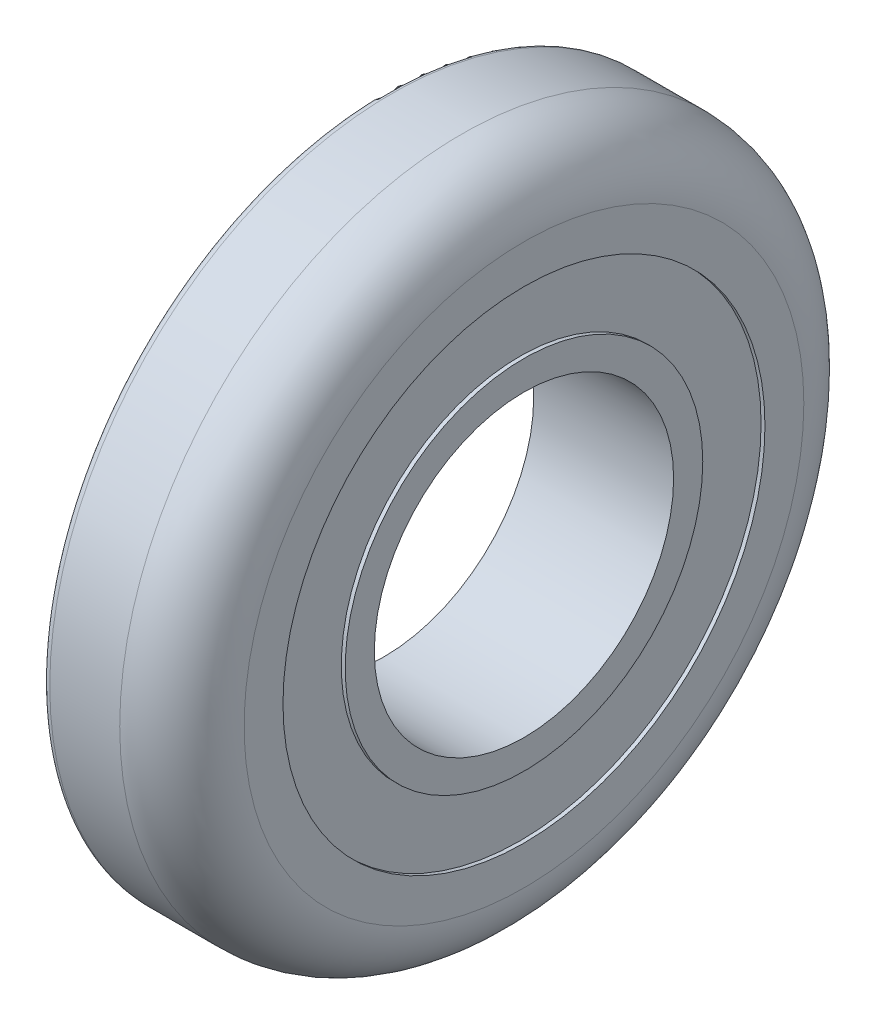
ISO-10303-21;
HEADER;
FILE_DESCRIPTION(('STEP AP214'),'2;1');
FILE_NAME('part.step','',(''),(''),'','','');
FILE_SCHEMA(('AUTOMOTIVE_DESIGN { 1 0 10303 214 1 1 1 1 }'));
ENDSEC;
DATA;
#1=APPLICATION_CONTEXT('core data for automotive mechanical design processes');
#2=APPLICATION_PROTOCOL_DEFINITION('international standard','automotive_design',2000,#1);
#3=PRODUCT_CONTEXT('',#1,'mechanical');
#4=PRODUCT('Part','Part','',(#3));
#5=PRODUCT_RELATED_PRODUCT_CATEGORY('part','',(#4));
#6=PRODUCT_DEFINITION_FORMATION('','',#4);
#7=PRODUCT_DEFINITION_CONTEXT('part definition',#1,'design');
#8=PRODUCT_DEFINITION('design','',#6,#7);
#9=PRODUCT_DEFINITION_SHAPE('','',#8);
#10=(LENGTH_UNIT() NAMED_UNIT(*) SI_UNIT(.MILLI.,.METRE.));
#11=(NAMED_UNIT(*) PLANE_ANGLE_UNIT() SI_UNIT($,.RADIAN.));
#12=(NAMED_UNIT(*) SI_UNIT($,.STERADIAN.) SOLID_ANGLE_UNIT());
#13=UNCERTAINTY_MEASURE_WITH_UNIT(LENGTH_MEASURE(1.E-05),#10,'distance_accuracy_value','');
#14=(GEOMETRIC_REPRESENTATION_CONTEXT(3) GLOBAL_UNCERTAINTY_ASSIGNED_CONTEXT((#13)) GLOBAL_UNIT_ASSIGNED_CONTEXT((#10,
#11,#12)) REPRESENTATION_CONTEXT('',''));
#15=CARTESIAN_POINT('',(0.,0.,0.));
#16=DIRECTION('',(0.,0.,1.));
#17=DIRECTION('',(1.,0.,0.));
#18=AXIS2_PLACEMENT_3D('',#15,#16,#17);
#19=CARTESIAN_POINT('',(0.,0.,0.));
#20=DIRECTION('',(1.,0.,0.));
#21=DIRECTION('',(0.,0.,-1.));
#22=AXIS2_PLACEMENT_3D('',#19,#20,#21);
#23=PLANE('',#22);
#24=CARTESIAN_POINT('',(0.,0.,0.));
#25=DIRECTION('',(1.,0.,0.));
#26=DIRECTION('',(0.,0.,-1.));
#27=AXIS2_PLACEMENT_3D('',#24,#25,#26);
#28=CIRCLE('',#27,19.25);
#29=CARTESIAN_POINT('',(0.,0.,-19.25));
#30=VERTEX_POINT('',#29);
#31=EDGE_CURVE('E53',#30,#30,#28,.T.);
#32=ORIENTED_EDGE('',*,*,#31,.T.);
#33=EDGE_LOOP('',(#32));
#34=FACE_BOUND('',#33,.T.);
#35=CARTESIAN_POINT('',(0.,0.,0.));
#36=DIRECTION('',(-1.,0.,0.));
#37=DIRECTION('',(0.,0.,1.));
#38=AXIS2_PLACEMENT_3D('',#35,#36,#37);
#39=CIRCLE('',#38,23.);
#40=CARTESIAN_POINT('',(0.,0.,23.));
#41=VERTEX_POINT('',#40);
#42=EDGE_CURVE('E77',#41,#41,#39,.T.);
#43=ORIENTED_EDGE('',*,*,#42,.T.);
#44=EDGE_LOOP('',(#43));
#45=FACE_BOUND('',#44,.T.);
#46=ADVANCED_FACE('F32',(#34,#45),#23,.F.);
#47=CARTESIAN_POINT('',(18.,0.,0.));
#48=DIRECTION('',(1.,0.,0.));
#49=DIRECTION('',(0.,0.,-1.));
#50=AXIS2_PLACEMENT_3D('',#47,#48,#49);
#51=PLANE('',#50);
#52=CARTESIAN_POINT('',(18.,0.,0.));
#53=DIRECTION('',(1.,0.,0.));
#54=DIRECTION('',(0.,0.,-1.));
#55=AXIS2_PLACEMENT_3D('',#52,#53,#54);
#56=CIRCLE('',#55,19.25);
#57=CARTESIAN_POINT('',(18.,0.,-19.25));
#58=VERTEX_POINT('',#57);
#59=EDGE_CURVE('E52',#58,#58,#56,.T.);
#60=ORIENTED_EDGE('',*,*,#59,.F.);
#61=EDGE_LOOP('',(#60));
#62=FACE_BOUND('',#61,.T.);
#63=CARTESIAN_POINT('',(18.,0.,0.));
#64=DIRECTION('',(1.,0.,0.));
#65=DIRECTION('',(0.,0.,-1.));
#66=AXIS2_PLACEMENT_3D('',#63,#64,#65);
#67=CIRCLE('',#66,23.);
#68=CARTESIAN_POINT('',(18.,0.,-23.));
#69=VERTEX_POINT('',#68);
#70=EDGE_CURVE('E65',#69,#69,#67,.T.);
#71=ORIENTED_EDGE('',*,*,#70,.T.);
#72=EDGE_LOOP('',(#71));
#73=FACE_BOUND('',#72,.T.);
#74=ADVANCED_FACE('F110',(#62,#73),#51,.T.);
#75=CARTESIAN_POINT('',(18.,0.,0.));
#76=DIRECTION('',(1.,0.,0.));
#77=DIRECTION('',(0.,0.,-1.));
#78=AXIS2_PLACEMENT_3D('',#75,#76,#77);
#79=CIRCLE('',#78,31.);
#80=CARTESIAN_POINT('',(18.,0.,-31.));
#81=VERTEX_POINT('',#80);
#82=EDGE_CURVE('E59',#81,#81,#79,.T.);
#83=ORIENTED_EDGE('',*,*,#82,.F.);
#84=EDGE_LOOP('',(#83));
#85=FACE_BOUND('',#84,.T.);
#86=CARTESIAN_POINT('',(18.,0.,0.));
#87=DIRECTION('',(1.,0.,0.));
#88=DIRECTION('',(0.,0.,-1.));
#89=AXIS2_PLACEMENT_3D('',#86,#87,#88);
#90=CIRCLE('',#89,36.);
#91=CARTESIAN_POINT('',(18.,0.,-36.));
#92=VERTEX_POINT('',#91);
#93=EDGE_CURVE('E47',#92,#92,#90,.T.);
#94=ORIENTED_EDGE('',*,*,#93,.T.);
#95=EDGE_LOOP('',(#94));
#96=FACE_BOUND('',#95,.T.);
#97=ADVANCED_FACE('F102',(#85,#96),#51,.T.);
#98=CARTESIAN_POINT('',(0.,0.,0.));
#99=DIRECTION('',(-1.,0.,0.));
#100=DIRECTION('',(0.,0.,1.));
#101=AXIS2_PLACEMENT_3D('',#98,#99,#100);
#102=CIRCLE('',#101,31.);
#103=CARTESIAN_POINT('',(0.,0.,31.));
#104=VERTEX_POINT('',#103);
#105=EDGE_CURVE('E71',#104,#104,#102,.T.);
#106=ORIENTED_EDGE('',*,*,#105,.F.);
#107=EDGE_LOOP('',(#106));
#108=FACE_BOUND('',#107,.T.);
#109=CARTESIAN_POINT('',(0.,0.,0.));
#110=DIRECTION('',(1.,0.,0.));
#111=DIRECTION('',(0.,0.,-1.));
#112=AXIS2_PLACEMENT_3D('',#109,#110,#111);
#113=CIRCLE('',#112,43.);
#114=CARTESIAN_POINT('',(0.,0.,-43.));
#115=VERTEX_POINT('',#114);
#116=EDGE_CURVE('E10',#115,#115,#113,.F.);
#117=ORIENTED_EDGE('',*,*,#116,.T.);
#118=EDGE_LOOP('',(#117));
#119=FACE_BOUND('',#118,.T.);
#120=ADVANCED_FACE('F99',(#108,#119),#23,.F.);
#121=CARTESIAN_POINT('',(18.,0.,0.));
#122=DIRECTION('',(-1.,0.,0.));
#123=DIRECTION('',(0.,0.,1.));
#124=AXIS2_PLACEMENT_3D('',#121,#122,#123);
#125=CYLINDRICAL_SURFACE('',#124,44.);
#126=CARTESIAN_POINT('',(1.,0.,0.));
#127=DIRECTION('',(1.,0.,0.));
#128=DIRECTION('',(0.,0.,-1.));
#129=AXIS2_PLACEMENT_3D('',#126,#127,#128);
#130=CIRCLE('',#129,44.);
#131=CARTESIAN_POINT('',(1.,0.,-44.));
#132=VERTEX_POINT('',#131);
#133=EDGE_CURVE('E39',#132,#132,#130,.T.);
#134=ORIENTED_EDGE('',*,*,#133,.T.);
#135=EDGE_LOOP('',(#134));
#136=FACE_BOUND('',#135,.T.);
#137=CARTESIAN_POINT('',(10.,0.,0.));
#138=DIRECTION('',(1.,0.,0.));
#139=DIRECTION('',(0.,0.,-1.));
#140=AXIS2_PLACEMENT_3D('',#137,#138,#139);
#141=CIRCLE('',#140,44.);
#142=CARTESIAN_POINT('',(10.,0.,-44.));
#143=VERTEX_POINT('',#142);
#144=EDGE_CURVE('E43',#143,#143,#141,.F.);
#145=ORIENTED_EDGE('',*,*,#144,.T.);
#146=EDGE_LOOP('',(#145));
#147=FACE_BOUND('',#146,.T.);
#148=ADVANCED_FACE('F101',(#136,#147),#125,.T.);
#149=CARTESIAN_POINT('',(18.,0.,0.));
#150=DIRECTION('',(-1.,0.,0.));
#151=DIRECTION('',(0.,0.,1.));
#152=AXIS2_PLACEMENT_3D('',#149,#150,#151);
#153=CYLINDRICAL_SURFACE('',#152,19.25);
#154=ORIENTED_EDGE('',*,*,#59,.T.);
#155=EDGE_LOOP('',(#154));
#156=FACE_BOUND('',#155,.T.);
#157=ORIENTED_EDGE('',*,*,#31,.F.);
#158=EDGE_LOOP('',(#157));
#159=FACE_BOUND('',#158,.T.);
#160=ADVANCED_FACE('F108',(#156,#159),#153,.F.);
#161=CARTESIAN_POINT('',(10.,0.,0.));
#162=DIRECTION('',(1.,0.,0.));
#163=DIRECTION('',(0.,0.,-1.));
#164=AXIS2_PLACEMENT_3D('',#161,#162,#163);
#165=TOROIDAL_SURFACE('',#164,36.,8.);
#166=ORIENTED_EDGE('',*,*,#144,.F.);
#167=EDGE_LOOP('',(#166));
#168=FACE_BOUND('',#167,.T.);
#169=ORIENTED_EDGE('',*,*,#93,.F.);
#170=EDGE_LOOP('',(#169));
#171=FACE_BOUND('',#170,.T.);
#172=ADVANCED_FACE('F139',(#168,#171),#165,.T.);
#173=CARTESIAN_POINT('',(1.,0.,0.));
#174=DIRECTION('',(1.,0.,0.));
#175=DIRECTION('',(0.,0.,-1.));
#176=AXIS2_PLACEMENT_3D('',#173,#174,#175);
#177=TOROIDAL_SURFACE('',#176,43.,1.);
#178=ORIENTED_EDGE('',*,*,#116,.F.);
#179=EDGE_LOOP('',(#178));
#180=FACE_BOUND('',#179,.T.);
#181=ORIENTED_EDGE('',*,*,#133,.F.);
#182=EDGE_LOOP('',(#181));
#183=FACE_BOUND('',#182,.T.);
#184=ADVANCED_FACE('F34',(#180,#183),#177,.T.);
#185=CARTESIAN_POINT('',(17.5,0.,0.));
#186=DIRECTION('',(1.,0.,0.));
#187=DIRECTION('',(0.,0.,-1.));
#188=AXIS2_PLACEMENT_3D('',#185,#186,#187);
#189=CYLINDRICAL_SURFACE('',#188,31.);
#190=CARTESIAN_POINT('',(17.5,0.,0.));
#191=DIRECTION('',(1.,0.,0.));
#192=DIRECTION('',(0.,0.,-1.));
#193=AXIS2_PLACEMENT_3D('',#190,#191,#192);
#194=CIRCLE('',#193,31.);
#195=CARTESIAN_POINT('',(17.5,0.,-31.));
#196=VERTEX_POINT('',#195);
#197=EDGE_CURVE('E56',#196,#196,#194,.T.);
#198=ORIENTED_EDGE('',*,*,#197,.F.);
#199=EDGE_LOOP('',(#198));
#200=FACE_BOUND('',#199,.T.);
#201=ORIENTED_EDGE('',*,*,#82,.T.);
#202=EDGE_LOOP('',(#201));
#203=FACE_BOUND('',#202,.T.);
#204=ADVANCED_FACE('F133',(#200,#203),#189,.F.);
#205=CARTESIAN_POINT('',(17.5,0.,0.));
#206=DIRECTION('',(1.,0.,0.));
#207=DIRECTION('',(0.,0.,-1.));
#208=AXIS2_PLACEMENT_3D('',#205,#206,#207);
#209=PLANE('',#208);
#210=CARTESIAN_POINT('',(17.5,0.,0.));
#211=DIRECTION('',(1.,0.,0.));
#212=DIRECTION('',(0.,0.,-1.));
#213=AXIS2_PLACEMENT_3D('',#210,#211,#212);
#214=CIRCLE('',#213,23.);
#215=CARTESIAN_POINT('',(17.5,0.,-23.));
#216=VERTEX_POINT('',#215);
#217=EDGE_CURVE('E62',#216,#216,#214,.T.);
#218=ORIENTED_EDGE('',*,*,#217,.F.);
#219=EDGE_LOOP('',(#218));
#220=FACE_BOUND('',#219,.T.);
#221=ORIENTED_EDGE('',*,*,#197,.T.);
#222=EDGE_LOOP('',(#221));
#223=FACE_BOUND('',#222,.T.);
#224=ADVANCED_FACE('F129',(#220,#223),#209,.T.);
#225=CARTESIAN_POINT('',(17.5,0.,0.));
#226=DIRECTION('',(1.,0.,0.));
#227=DIRECTION('',(0.,0.,-1.));
#228=AXIS2_PLACEMENT_3D('',#225,#226,#227);
#229=CYLINDRICAL_SURFACE('',#228,23.);
#230=ORIENTED_EDGE('',*,*,#217,.T.);
#231=EDGE_LOOP('',(#230));
#232=FACE_BOUND('',#231,.T.);
#233=ORIENTED_EDGE('',*,*,#70,.F.);
#234=EDGE_LOOP('',(#233));
#235=FACE_BOUND('',#234,.T.);
#236=ADVANCED_FACE('F95',(#232,#235),#229,.T.);
#237=CARTESIAN_POINT('',(0.5,0.,0.));
#238=DIRECTION('',(-1.,0.,0.));
#239=DIRECTION('',(0.,0.,1.));
#240=AXIS2_PLACEMENT_3D('',#237,#238,#239);
#241=CYLINDRICAL_SURFACE('',#240,31.);
#242=CARTESIAN_POINT('',(0.5,0.,0.));
#243=DIRECTION('',(-1.,0.,0.));
#244=DIRECTION('',(0.,0.,1.));
#245=AXIS2_PLACEMENT_3D('',#242,#243,#244);
#246=CIRCLE('',#245,31.);
#247=CARTESIAN_POINT('',(0.5,0.,31.));
#248=VERTEX_POINT('',#247);
#249=EDGE_CURVE('E68',#248,#248,#246,.T.);
#250=ORIENTED_EDGE('',*,*,#249,.F.);
#251=EDGE_LOOP('',(#250));
#252=FACE_BOUND('',#251,.T.);
#253=ORIENTED_EDGE('',*,*,#105,.T.);
#254=EDGE_LOOP('',(#253));
#255=FACE_BOUND('',#254,.T.);
#256=ADVANCED_FACE('F89',(#252,#255),#241,.F.);
#257=CARTESIAN_POINT('',(0.5,0.,0.));
#258=DIRECTION('',(-1.,0.,0.));
#259=DIRECTION('',(0.,0.,1.));
#260=AXIS2_PLACEMENT_3D('',#257,#258,#259);
#261=PLANE('',#260);
#262=CARTESIAN_POINT('',(0.5,0.,0.));
#263=DIRECTION('',(-1.,0.,0.));
#264=DIRECTION('',(0.,0.,1.));
#265=AXIS2_PLACEMENT_3D('',#262,#263,#264);
#266=CIRCLE('',#265,23.);
#267=CARTESIAN_POINT('',(0.5,0.,23.));
#268=VERTEX_POINT('',#267);
#269=EDGE_CURVE('E74',#268,#268,#266,.T.);
#270=ORIENTED_EDGE('',*,*,#269,.F.);
#271=EDGE_LOOP('',(#270));
#272=FACE_BOUND('',#271,.T.);
#273=ORIENTED_EDGE('',*,*,#249,.T.);
#274=EDGE_LOOP('',(#273));
#275=FACE_BOUND('',#274,.T.);
#276=ADVANCED_FACE('F86',(#272,#275),#261,.T.);
#277=CARTESIAN_POINT('',(0.5,0.,0.));
#278=DIRECTION('',(-1.,0.,0.));
#279=DIRECTION('',(0.,0.,1.));
#280=AXIS2_PLACEMENT_3D('',#277,#278,#279);
#281=CYLINDRICAL_SURFACE('',#280,23.);
#282=ORIENTED_EDGE('',*,*,#269,.T.);
#283=EDGE_LOOP('',(#282));
#284=FACE_BOUND('',#283,.T.);
#285=ORIENTED_EDGE('',*,*,#42,.F.);
#286=EDGE_LOOP('',(#285));
#287=FACE_BOUND('',#286,.T.);
#288=ADVANCED_FACE('F83',(#284,#287),#281,.T.);
#289=CLOSED_SHELL('',(#46,#74,#97,#120,#148,#160,#172,#184,#204,#224,#236,#256,#276,#288));
#290=MANIFOLD_SOLID_BREP('B2',#289);
#291=ADVANCED_BREP_SHAPE_REPRESENTATION('',(#18,#290),#14);
#292=SHAPE_DEFINITION_REPRESENTATION(#9,#291);
ENDSEC;
END-ISO-10303-21;
